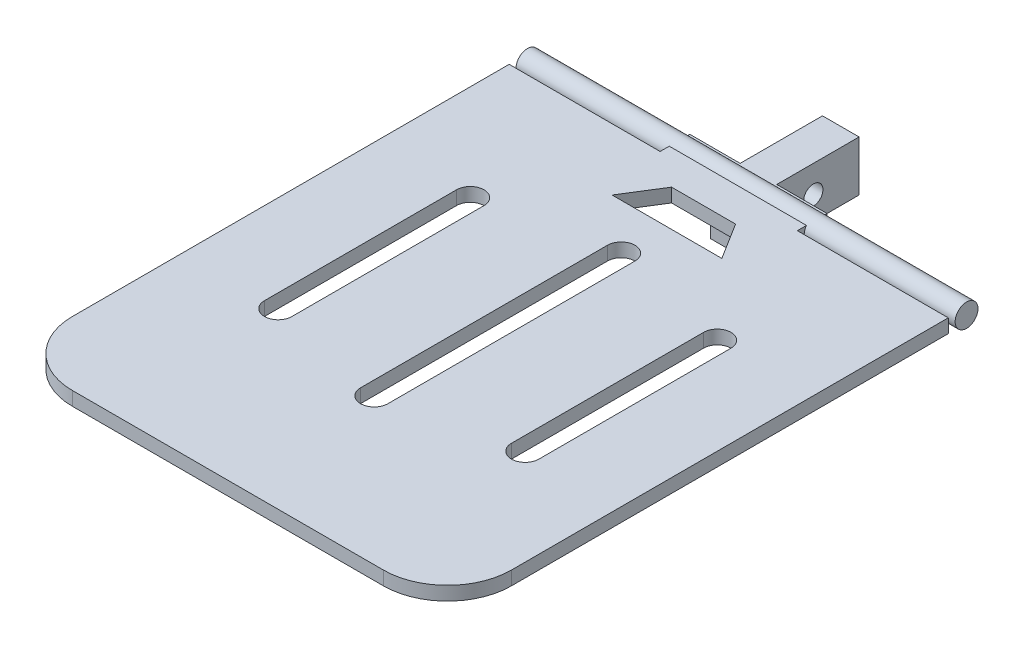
ISO-10303-21;
HEADER;
FILE_DESCRIPTION(('STEP AP214'),'2;1');
FILE_NAME('part.step','',(''),(''),'','','');
FILE_SCHEMA(('AUTOMOTIVE_DESIGN { 1 0 10303 214 1 1 1 1 }'));
ENDSEC;
DATA;
#1=APPLICATION_CONTEXT('core data for automotive mechanical design processes');
#2=APPLICATION_PROTOCOL_DEFINITION('international standard','automotive_design',2000,#1);
#3=PRODUCT_CONTEXT('',#1,'mechanical');
#4=PRODUCT('Part','Part','',(#3));
#5=PRODUCT_RELATED_PRODUCT_CATEGORY('part','',(#4));
#6=PRODUCT_DEFINITION_FORMATION('','',#4);
#7=PRODUCT_DEFINITION_CONTEXT('part definition',#1,'design');
#8=PRODUCT_DEFINITION('design','',#6,#7);
#9=PRODUCT_DEFINITION_SHAPE('','',#8);
#10=(LENGTH_UNIT() NAMED_UNIT(*) SI_UNIT(.MILLI.,.METRE.));
#11=(NAMED_UNIT(*) PLANE_ANGLE_UNIT() SI_UNIT($,.RADIAN.));
#12=(NAMED_UNIT(*) SI_UNIT($,.STERADIAN.) SOLID_ANGLE_UNIT());
#13=UNCERTAINTY_MEASURE_WITH_UNIT(LENGTH_MEASURE(1.E-05),#10,'distance_accuracy_value','');
#14=(GEOMETRIC_REPRESENTATION_CONTEXT(3) GLOBAL_UNCERTAINTY_ASSIGNED_CONTEXT((#13)) GLOBAL_UNIT_ASSIGNED_CONTEXT((#10,
#11,#12)) REPRESENTATION_CONTEXT('',''));
#15=CARTESIAN_POINT('',(0.,0.,0.));
#16=DIRECTION('',(0.,0.,1.));
#17=DIRECTION('',(1.,0.,0.));
#18=AXIS2_PLACEMENT_3D('',#15,#16,#17);
#19=CARTESIAN_POINT('',(34.,6.,110.));
#20=DIRECTION('',(0.,-1.,0.));
#21=DIRECTION('',(0.,0.,-1.));
#22=AXIS2_PLACEMENT_3D('',#19,#20,#21);
#23=PLANE('',#22);
#24=CARTESIAN_POINT('',(27.,6.,44.));
#25=DIRECTION('',(0.,-1.,0.));
#26=DIRECTION('',(0.,0.,-1.));
#27=AXIS2_PLACEMENT_3D('',#24,#25,#26);
#28=CIRCLE('',#27,3.);
#29=CARTESIAN_POINT('',(30.,6.,44.));
#30=VERTEX_POINT('',#29);
#31=CARTESIAN_POINT('',(24.,6.,44.));
#32=VERTEX_POINT('',#31);
#33=EDGE_CURVE('E520',#30,#32,#28,.F.);
#34=ORIENTED_EDGE('',*,*,#33,.F.);
#35=DIRECTION('',(0.,0.,-1.));
#36=VECTOR('',#35,1.);
#37=CARTESIAN_POINT('',(30.,6.,110.));
#38=LINE('',#37,#36);
#39=CARTESIAN_POINT('',(30.,6.,86.));
#40=VERTEX_POINT('',#39);
#41=EDGE_CURVE('E513',#40,#30,#38,.T.);
#42=ORIENTED_EDGE('',*,*,#41,.F.);
#43=CARTESIAN_POINT('',(27.,6.,86.));
#44=DIRECTION('',(0.,-1.,0.));
#45=DIRECTION('',(0.,0.,-1.));
#46=AXIS2_PLACEMENT_3D('',#43,#44,#45);
#47=CIRCLE('',#46,3.);
#48=CARTESIAN_POINT('',(24.,6.,86.));
#49=VERTEX_POINT('',#48);
#50=EDGE_CURVE('E515',#49,#40,#47,.F.);
#51=ORIENTED_EDGE('',*,*,#50,.F.);
#52=DIRECTION('',(0.,0.,1.));
#53=VECTOR('',#52,1.);
#54=CARTESIAN_POINT('',(24.,6.,110.));
#55=LINE('',#54,#53);
#56=EDGE_CURVE('E518',#32,#49,#55,.T.);
#57=ORIENTED_EDGE('',*,*,#56,.F.);
#58=EDGE_LOOP('',(#34,#42,#51,#57));
#59=FACE_BOUND('',#58,.T.);
#60=CARTESIAN_POINT('',(0.,6.,38.));
#61=DIRECTION('',(0.,-1.,0.));
#62=DIRECTION('',(0.,0.,-1.));
#63=AXIS2_PLACEMENT_3D('',#60,#61,#62);
#64=CIRCLE('',#63,3.);
#65=CARTESIAN_POINT('',(3.,6.,38.));
#66=VERTEX_POINT('',#65);
#67=CARTESIAN_POINT('',(-3.,6.,38.));
#68=VERTEX_POINT('',#67);
#69=EDGE_CURVE('E478',#66,#68,#64,.F.);
#70=ORIENTED_EDGE('',*,*,#69,.F.);
#71=DIRECTION('',(0.,0.,-1.));
#72=VECTOR('',#71,1.);
#73=CARTESIAN_POINT('',(3.,6.,110.));
#74=LINE('',#73,#72);
#75=CARTESIAN_POINT('',(3.,6.,92.));
#76=VERTEX_POINT('',#75);
#77=EDGE_CURVE('E471',#76,#66,#74,.T.);
#78=ORIENTED_EDGE('',*,*,#77,.F.);
#79=CARTESIAN_POINT('',(0.,6.,92.));
#80=DIRECTION('',(0.,-1.,0.));
#81=DIRECTION('',(0.,0.,-1.));
#82=AXIS2_PLACEMENT_3D('',#79,#80,#81);
#83=CIRCLE('',#82,3.);
#84=CARTESIAN_POINT('',(-3.,6.,92.));
#85=VERTEX_POINT('',#84);
#86=EDGE_CURVE('E473',#85,#76,#83,.F.);
#87=ORIENTED_EDGE('',*,*,#86,.F.);
#88=DIRECTION('',(0.,0.,1.));
#89=VECTOR('',#88,1.);
#90=CARTESIAN_POINT('',(-3.,6.,110.));
#91=LINE('',#90,#89);
#92=EDGE_CURVE('E476',#68,#85,#91,.T.);
#93=ORIENTED_EDGE('',*,*,#92,.F.);
#94=EDGE_LOOP('',(#70,#78,#87,#93));
#95=FACE_BOUND('',#94,.T.);
#96=DIRECTION('',(1.,0.,0.));
#97=VECTOR('',#96,1.);
#98=CARTESIAN_POINT('',(-48.,6.,12.5));
#99=LINE('',#98,#97);
#100=CARTESIAN_POINT('',(15.,6.,12.5));
#101=VERTEX_POINT('',#100);
#102=CARTESIAN_POINT('',(-15.,6.,12.5));
#103=VERTEX_POINT('',#102);
#104=EDGE_CURVE('E375',#101,#103,#99,.F.);
#105=ORIENTED_EDGE('',*,*,#104,.T.);
#106=DIRECTION('',(0.,0.,1.));
#107=VECTOR('',#106,1.);
#108=CARTESIAN_POINT('',(-15.,6.,16.));
#109=LINE('',#108,#107);
#110=CARTESIAN_POINT('',(-15.,6.,14.5));
#111=VERTEX_POINT('',#110);
#112=EDGE_CURVE('E396',#103,#111,#109,.T.);
#113=ORIENTED_EDGE('',*,*,#112,.T.);
#114=DIRECTION('',(-1.,0.,0.));
#115=VECTOR('',#114,1.);
#116=CARTESIAN_POINT('',(-48.,6.,14.5));
#117=LINE('',#116,#115);
#118=CARTESIAN_POINT('',(-48.,6.,14.5));
#119=VERTEX_POINT('',#118);
#120=EDGE_CURVE('E451',#111,#119,#117,.T.);
#121=ORIENTED_EDGE('',*,*,#120,.T.);
#122=DIRECTION('',(0.,0.,1.));
#123=VECTOR('',#122,1.);
#124=CARTESIAN_POINT('',(-48.,6.,110.));
#125=LINE('',#124,#123);
#126=CARTESIAN_POINT('',(-48.,6.,110.));
#127=VERTEX_POINT('',#126);
#128=EDGE_CURVE('E415',#119,#127,#125,.T.);
#129=ORIENTED_EDGE('',*,*,#128,.T.);
#130=CARTESIAN_POINT('',(-34.,6.,110.));
#131=DIRECTION('',(0.,1.,0.));
#132=DIRECTION('',(0.,0.,-1.));
#133=AXIS2_PLACEMENT_3D('',#130,#131,#132);
#134=CIRCLE('',#133,14.);
#135=CARTESIAN_POINT('',(-34.,6.,124.));
#136=VERTEX_POINT('',#135);
#137=EDGE_CURVE('E439',#127,#136,#134,.T.);
#138=ORIENTED_EDGE('',*,*,#137,.T.);
#139=DIRECTION('',(1.,0.,0.));
#140=VECTOR('',#139,1.);
#141=CARTESIAN_POINT('',(34.,6.,124.));
#142=LINE('',#141,#140);
#143=CARTESIAN_POINT('',(34.,6.,124.));
#144=VERTEX_POINT('',#143);
#145=EDGE_CURVE('E442',#136,#144,#142,.T.);
#146=ORIENTED_EDGE('',*,*,#145,.T.);
#147=CARTESIAN_POINT('',(34.,6.,110.));
#148=DIRECTION('',(0.,1.,0.));
#149=DIRECTION('',(0.,0.,-1.));
#150=AXIS2_PLACEMENT_3D('',#147,#148,#149);
#151=CIRCLE('',#150,14.);
#152=CARTESIAN_POINT('',(48.,6.,110.));
#153=VERTEX_POINT('',#152);
#154=EDGE_CURVE('E445',#144,#153,#151,.T.);
#155=ORIENTED_EDGE('',*,*,#154,.T.);
#156=DIRECTION('',(0.,0.,-1.));
#157=VECTOR('',#156,1.);
#158=CARTESIAN_POINT('',(48.,6.,14.5));
#159=LINE('',#158,#157);
#160=CARTESIAN_POINT('',(48.,6.,14.5));
#161=VERTEX_POINT('',#160);
#162=EDGE_CURVE('E448',#153,#161,#159,.T.);
#163=ORIENTED_EDGE('',*,*,#162,.T.);
#164=CARTESIAN_POINT('',(15.,6.,14.5));
#165=VERTEX_POINT('',#164);
#166=EDGE_CURVE('E420',#161,#165,#117,.T.);
#167=ORIENTED_EDGE('',*,*,#166,.T.);
#168=DIRECTION('',(0.,0.,-1.));
#169=VECTOR('',#168,1.);
#170=CARTESIAN_POINT('',(15.,6.,16.));
#171=LINE('',#170,#169);
#172=EDGE_CURVE('E397',#165,#101,#171,.T.);
#173=ORIENTED_EDGE('',*,*,#172,.T.);
#174=EDGE_LOOP('',(#105,#113,#121,#129,#138,#146,#155,#163,#167,#173));
#175=FACE_BOUND('',#174,.T.);
#176=CARTESIAN_POINT('',(-27.,6.,44.));
#177=DIRECTION('',(0.,-1.,0.));
#178=DIRECTION('',(0.,0.,-1.));
#179=AXIS2_PLACEMENT_3D('',#176,#177,#178);
#180=CIRCLE('',#179,3.);
#181=CARTESIAN_POINT('',(-24.,6.,44.));
#182=VERTEX_POINT('',#181);
#183=CARTESIAN_POINT('',(-30.,6.,44.));
#184=VERTEX_POINT('',#183);
#185=EDGE_CURVE('E499',#182,#184,#180,.F.);
#186=ORIENTED_EDGE('',*,*,#185,.F.);
#187=DIRECTION('',(0.,0.,-1.));
#188=VECTOR('',#187,1.);
#189=CARTESIAN_POINT('',(-24.,6.,110.));
#190=LINE('',#189,#188);
#191=CARTESIAN_POINT('',(-24.,6.,86.));
#192=VERTEX_POINT('',#191);
#193=EDGE_CURVE('E492',#192,#182,#190,.T.);
#194=ORIENTED_EDGE('',*,*,#193,.F.);
#195=CARTESIAN_POINT('',(-27.,6.,86.));
#196=DIRECTION('',(0.,-1.,0.));
#197=DIRECTION('',(0.,0.,-1.));
#198=AXIS2_PLACEMENT_3D('',#195,#196,#197);
#199=CIRCLE('',#198,3.);
#200=CARTESIAN_POINT('',(-30.,6.,86.));
#201=VERTEX_POINT('',#200);
#202=EDGE_CURVE('E494',#201,#192,#199,.F.);
#203=ORIENTED_EDGE('',*,*,#202,.F.);
#204=DIRECTION('',(0.,0.,1.));
#205=VECTOR('',#204,1.);
#206=CARTESIAN_POINT('',(-30.,6.,110.));
#207=LINE('',#206,#205);
#208=EDGE_CURVE('E497',#184,#201,#207,.T.);
#209=ORIENTED_EDGE('',*,*,#208,.F.);
#210=EDGE_LOOP('',(#186,#194,#203,#209));
#211=FACE_BOUND('',#210,.T.);
#212=DIRECTION('',(-0.52999894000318,0.,0.847998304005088));
#213=VECTOR('',#212,1.);
#214=CARTESIAN_POINT('',(-35.9325842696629,6.,66.2921348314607));
#215=LINE('',#214,#213);
#216=CARTESIAN_POINT('',(-7.,6.,20.));
#217=VERTEX_POINT('',#216);
#218=CARTESIAN_POINT('',(-12.,6.,28.));
#219=VERTEX_POINT('',#218);
#220=EDGE_CURVE('E298',#217,#219,#215,.T.);
#221=ORIENTED_EDGE('',*,*,#220,.F.);
#222=DIRECTION('',(-1.,0.,0.));
#223=VECTOR('',#222,1.);
#224=CARTESIAN_POINT('',(34.,6.,20.));
#225=LINE('',#224,#223);
#226=CARTESIAN_POINT('',(7.,6.,20.));
#227=VERTEX_POINT('',#226);
#228=EDGE_CURVE('E534',#227,#217,#225,.T.);
#229=ORIENTED_EDGE('',*,*,#228,.F.);
#230=DIRECTION('',(-0.52999894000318,0.,-0.847998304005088));
#231=VECTOR('',#230,1.);
#232=CARTESIAN_POINT('',(55.0337078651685,6.,96.8539325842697));
#233=LINE('',#232,#231);
#234=CARTESIAN_POINT('',(12.,6.,28.));
#235=VERTEX_POINT('',#234);
#236=EDGE_CURVE('E536',#235,#227,#233,.T.);
#237=ORIENTED_EDGE('',*,*,#236,.F.);
#238=DIRECTION('',(1.,0.,0.));
#239=VECTOR('',#238,1.);
#240=CARTESIAN_POINT('',(34.,6.,28.));
#241=LINE('',#240,#239);
#242=EDGE_CURVE('E538',#219,#235,#241,.T.);
#243=ORIENTED_EDGE('',*,*,#242,.F.);
#244=EDGE_LOOP('',(#221,#229,#237,#243));
#245=FACE_BOUND('',#244,.T.);
#246=ADVANCED_FACE('F39',(#59,#95,#175,#211,#245),#23,.F.);
#247=CARTESIAN_POINT('',(34.,3.,110.));
#248=DIRECTION('',(0.,-1.,0.));
#249=DIRECTION('',(0.,0.,-1.));
#250=AXIS2_PLACEMENT_3D('',#247,#248,#249);
#251=PLANE('',#250);
#252=DIRECTION('',(0.,0.,-1.));
#253=VECTOR('',#252,1.);
#254=CARTESIAN_POINT('',(-4.,3.,110.));
#255=LINE('',#254,#253);
#256=CARTESIAN_POINT('',(-4.,3.,8.49999999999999));
#257=VERTEX_POINT('',#256);
#258=CARTESIAN_POINT('',(-4.,3.,8.));
#259=VERTEX_POINT('',#258);
#260=EDGE_CURVE('E355',#257,#259,#255,.T.);
#261=ORIENTED_EDGE('',*,*,#260,.F.);
#262=DIRECTION('',(1.,0.,0.));
#263=VECTOR('',#262,1.);
#264=CARTESIAN_POINT('',(-48.,3.,8.5));
#265=LINE('',#264,#263);
#266=CARTESIAN_POINT('',(-15.,3.,8.5));
#267=VERTEX_POINT('',#266);
#268=EDGE_CURVE('E367',#267,#257,#265,.T.);
#269=ORIENTED_EDGE('',*,*,#268,.F.);
#270=DIRECTION('',(0.,0.,1.));
#271=VECTOR('',#270,1.);
#272=CARTESIAN_POINT('',(-15.,3.,16.));
#273=LINE('',#272,#271);
#274=CARTESIAN_POINT('',(-15.,3.,8.));
#275=VERTEX_POINT('',#274);
#276=EDGE_CURVE('E380',#275,#267,#273,.T.);
#277=ORIENTED_EDGE('',*,*,#276,.F.);
#278=DIRECTION('',(-1.,0.,0.));
#279=VECTOR('',#278,1.);
#280=CARTESIAN_POINT('',(-15.,3.,8.));
#281=LINE('',#280,#279);
#282=EDGE_CURVE('E387',#259,#275,#281,.T.);
#283=ORIENTED_EDGE('',*,*,#282,.F.);
#284=EDGE_LOOP('',(#261,#269,#277,#283));
#285=FACE_BOUND('',#284,.T.);
#286=ADVANCED_FACE('F557',(#285),#251,.T.);
#287=CARTESIAN_POINT('',(-15.,3.,8.));
#288=DIRECTION('',(0.,0.,-1.));
#289=DIRECTION('',(-1.,0.,0.));
#290=AXIS2_PLACEMENT_3D('',#287,#288,#289);
#291=PLANE('',#290);
#292=DIRECTION('',(0.,1.,0.));
#293=VECTOR('',#292,1.);
#294=CARTESIAN_POINT('',(-4.,3.,8.));
#295=LINE('',#294,#293);
#296=CARTESIAN_POINT('',(-4.,6.,8.));
#297=VERTEX_POINT('',#296);
#298=EDGE_CURVE('E609',#259,#297,#295,.T.);
#299=ORIENTED_EDGE('',*,*,#298,.F.);
#300=ORIENTED_EDGE('',*,*,#282,.T.);
#301=DIRECTION('',(0.,1.,0.));
#302=VECTOR('',#301,1.);
#303=CARTESIAN_POINT('',(-15.,3.,8.));
#304=LINE('',#303,#302);
#305=CARTESIAN_POINT('',(-15.,4.5,8.));
#306=VERTEX_POINT('',#305);
#307=EDGE_CURVE('E404',#275,#306,#304,.T.);
#308=ORIENTED_EDGE('',*,*,#307,.T.);
#309=CARTESIAN_POINT('',(-15.,6.,8.));
#310=VERTEX_POINT('',#309);
#311=EDGE_CURVE('E408',#306,#310,#304,.T.);
#312=ORIENTED_EDGE('',*,*,#311,.T.);
#313=DIRECTION('',(-1.,0.,0.));
#314=VECTOR('',#313,1.);
#315=CARTESIAN_POINT('',(-15.,6.,8.));
#316=LINE('',#315,#314);
#317=EDGE_CURVE('E400',#297,#310,#316,.T.);
#318=ORIENTED_EDGE('',*,*,#317,.F.);
#319=EDGE_LOOP('',(#299,#300,#308,#312,#318));
#320=FACE_BOUND('',#319,.T.);
#321=ADVANCED_FACE('F563',(#320),#291,.T.);
#322=CARTESIAN_POINT('',(15.,3.,16.));
#323=DIRECTION('',(1.,0.,0.));
#324=DIRECTION('',(0.,0.,-1.));
#325=AXIS2_PLACEMENT_3D('',#322,#323,#324);
#326=PLANE('',#325);
#327=CARTESIAN_POINT('',(15.,4.5,10.5));
#328=DIRECTION('',(1.,0.,0.));
#329=DIRECTION('',(0.,0.,-1.));
#330=AXIS2_PLACEMENT_3D('',#327,#328,#329);
#331=CIRCLE('',#330,2.5);
#332=CARTESIAN_POINT('',(15.,3.,12.5));
#333=VERTEX_POINT('',#332);
#334=EDGE_CURVE('E470',#101,#333,#331,.T.);
#335=ORIENTED_EDGE('',*,*,#334,.F.);
#336=ORIENTED_EDGE('',*,*,#172,.F.);
#337=DIRECTION('',(0.,-1.,0.));
#338=VECTOR('',#337,1.);
#339=CARTESIAN_POINT('',(15.,3.,14.5));
#340=LINE('',#339,#338);
#341=CARTESIAN_POINT('',(15.,3.,14.5));
#342=VERTEX_POINT('',#341);
#343=EDGE_CURVE('E407',#165,#342,#340,.T.);
#344=ORIENTED_EDGE('',*,*,#343,.T.);
#345=DIRECTION('',(0.,0.,-1.));
#346=VECTOR('',#345,1.);
#347=CARTESIAN_POINT('',(15.,3.,16.));
#348=LINE('',#347,#346);
#349=EDGE_CURVE('E385',#342,#333,#348,.T.);
#350=ORIENTED_EDGE('',*,*,#349,.T.);
#351=EDGE_LOOP('',(#335,#336,#344,#350));
#352=FACE_BOUND('',#351,.T.);
#353=ADVANCED_FACE('F666',(#352),#326,.T.);
#354=CARTESIAN_POINT('',(-48.,3.,14.5));
#355=DIRECTION('',(0.,0.,-1.));
#356=DIRECTION('',(-1.,0.,0.));
#357=AXIS2_PLACEMENT_3D('',#354,#355,#356);
#358=PLANE('',#357);
#359=DIRECTION('',(0.,1.,0.));
#360=VECTOR('',#359,1.);
#361=CARTESIAN_POINT('',(-15.,3.,14.5));
#362=LINE('',#361,#360);
#363=CARTESIAN_POINT('',(-15.,3.,14.5));
#364=VERTEX_POINT('',#363);
#365=EDGE_CURVE('E412',#364,#111,#362,.T.);
#366=ORIENTED_EDGE('',*,*,#365,.F.);
#367=DIRECTION('',(-1.,0.,0.));
#368=VECTOR('',#367,1.);
#369=CARTESIAN_POINT('',(-48.,3.,14.5));
#370=LINE('',#369,#368);
#371=CARTESIAN_POINT('',(-48.,3.,14.5));
#372=VERTEX_POINT('',#371);
#373=EDGE_CURVE('E432',#364,#372,#370,.T.);
#374=ORIENTED_EDGE('',*,*,#373,.T.);
#375=DIRECTION('',(0.,1.,0.));
#376=VECTOR('',#375,1.);
#377=CARTESIAN_POINT('',(-48.,3.,14.5));
#378=LINE('',#377,#376);
#379=EDGE_CURVE('E454',#372,#119,#378,.T.);
#380=ORIENTED_EDGE('',*,*,#379,.T.);
#381=ORIENTED_EDGE('',*,*,#120,.F.);
#382=EDGE_LOOP('',(#366,#374,#380,#381));
#383=FACE_BOUND('',#382,.T.);
#384=ADVANCED_FACE('F640',(#383),#358,.T.);
#385=CARTESIAN_POINT('',(-48.,3.,110.));
#386=DIRECTION('',(-1.,0.,0.));
#387=DIRECTION('',(0.,0.,1.));
#388=AXIS2_PLACEMENT_3D('',#385,#386,#387);
#389=PLANE('',#388);
#390=ORIENTED_EDGE('',*,*,#128,.F.);
#391=ORIENTED_EDGE('',*,*,#379,.F.);
#392=DIRECTION('',(0.,0.,1.));
#393=VECTOR('',#392,1.);
#394=CARTESIAN_POINT('',(-48.,3.,110.));
#395=LINE('',#394,#393);
#396=CARTESIAN_POINT('',(-48.,3.,110.));
#397=VERTEX_POINT('',#396);
#398=EDGE_CURVE('E416',#372,#397,#395,.T.);
#399=ORIENTED_EDGE('',*,*,#398,.T.);
#400=DIRECTION('',(0.,1.,0.));
#401=VECTOR('',#400,1.);
#402=CARTESIAN_POINT('',(-48.,3.,110.));
#403=LINE('',#402,#401);
#404=EDGE_CURVE('E436',#397,#127,#403,.T.);
#405=ORIENTED_EDGE('',*,*,#404,.T.);
#406=EDGE_LOOP('',(#390,#391,#399,#405));
#407=FACE_BOUND('',#406,.T.);
#408=ADVANCED_FACE('F41',(#407),#389,.T.);
#409=ORIENTED_EDGE('',*,*,#343,.F.);
#410=ORIENTED_EDGE('',*,*,#166,.F.);
#411=DIRECTION('',(0.,1.,0.));
#412=VECTOR('',#411,1.);
#413=CARTESIAN_POINT('',(48.,3.,14.5));
#414=LINE('',#413,#412);
#415=CARTESIAN_POINT('',(48.,3.,14.5));
#416=VERTEX_POINT('',#415);
#417=EDGE_CURVE('E458',#416,#161,#414,.T.);
#418=ORIENTED_EDGE('',*,*,#417,.F.);
#419=EDGE_CURVE('E433',#416,#342,#370,.T.);
#420=ORIENTED_EDGE('',*,*,#419,.T.);
#421=EDGE_LOOP('',(#409,#410,#418,#420));
#422=FACE_BOUND('',#421,.T.);
#423=ADVANCED_FACE('F662',(#422),#358,.T.);
#424=CARTESIAN_POINT('',(48.,3.,14.5));
#425=DIRECTION('',(1.,0.,0.));
#426=DIRECTION('',(0.,0.,-1.));
#427=AXIS2_PLACEMENT_3D('',#424,#425,#426);
#428=PLANE('',#427);
#429=ORIENTED_EDGE('',*,*,#162,.F.);
#430=DIRECTION('',(0.,1.,0.));
#431=VECTOR('',#430,1.);
#432=CARTESIAN_POINT('',(48.,3.,110.));
#433=LINE('',#432,#431);
#434=CARTESIAN_POINT('',(48.,3.,110.));
#435=VERTEX_POINT('',#434);
#436=EDGE_CURVE('E460',#435,#153,#433,.T.);
#437=ORIENTED_EDGE('',*,*,#436,.F.);
#438=DIRECTION('',(0.,0.,-1.));
#439=VECTOR('',#438,1.);
#440=CARTESIAN_POINT('',(48.,3.,14.5));
#441=LINE('',#440,#439);
#442=EDGE_CURVE('E429',#435,#416,#441,.T.);
#443=ORIENTED_EDGE('',*,*,#442,.T.);
#444=ORIENTED_EDGE('',*,*,#417,.T.);
#445=EDGE_LOOP('',(#429,#437,#443,#444));
#446=FACE_BOUND('',#445,.T.);
#447=ADVANCED_FACE('F1056',(#446),#428,.T.);
#448=CARTESIAN_POINT('',(34.,3.,110.));
#449=DIRECTION('',(0.,1.,0.));
#450=DIRECTION('',(0.,0.,1.));
#451=AXIS2_PLACEMENT_3D('',#448,#449,#450);
#452=CYLINDRICAL_SURFACE('',#451,14.);
#453=ORIENTED_EDGE('',*,*,#154,.F.);
#454=DIRECTION('',(0.,1.,0.));
#455=VECTOR('',#454,1.);
#456=CARTESIAN_POINT('',(34.,3.,124.));
#457=LINE('',#456,#455);
#458=CARTESIAN_POINT('',(34.,3.,124.));
#459=VERTEX_POINT('',#458);
#460=EDGE_CURVE('E462',#459,#144,#457,.T.);
#461=ORIENTED_EDGE('',*,*,#460,.F.);
#462=CARTESIAN_POINT('',(34.,3.,110.));
#463=DIRECTION('',(0.,1.,0.));
#464=DIRECTION('',(0.,0.,-1.));
#465=AXIS2_PLACEMENT_3D('',#462,#463,#464);
#466=CIRCLE('',#465,14.);
#467=EDGE_CURVE('E426',#459,#435,#466,.T.);
#468=ORIENTED_EDGE('',*,*,#467,.T.);
#469=ORIENTED_EDGE('',*,*,#436,.T.);
#470=EDGE_LOOP('',(#453,#461,#468,#469));
#471=FACE_BOUND('',#470,.T.);
#472=ADVANCED_FACE('F656',(#471),#452,.T.);
#473=CARTESIAN_POINT('',(34.,3.,124.));
#474=DIRECTION('',(0.,0.,1.));
#475=DIRECTION('',(1.,0.,0.));
#476=AXIS2_PLACEMENT_3D('',#473,#474,#475);
#477=PLANE('',#476);
#478=ORIENTED_EDGE('',*,*,#145,.F.);
#479=DIRECTION('',(0.,1.,0.));
#480=VECTOR('',#479,1.);
#481=CARTESIAN_POINT('',(-34.,3.,124.));
#482=LINE('',#481,#480);
#483=CARTESIAN_POINT('',(-34.,3.,124.));
#484=VERTEX_POINT('',#483);
#485=EDGE_CURVE('E464',#484,#136,#482,.T.);
#486=ORIENTED_EDGE('',*,*,#485,.F.);
#487=DIRECTION('',(1.,0.,0.));
#488=VECTOR('',#487,1.);
#489=CARTESIAN_POINT('',(34.,3.,124.));
#490=LINE('',#489,#488);
#491=EDGE_CURVE('E423',#484,#459,#490,.T.);
#492=ORIENTED_EDGE('',*,*,#491,.T.);
#493=ORIENTED_EDGE('',*,*,#460,.T.);
#494=EDGE_LOOP('',(#478,#486,#492,#493));
#495=FACE_BOUND('',#494,.T.);
#496=ADVANCED_FACE('F652',(#495),#477,.T.);
#497=CARTESIAN_POINT('',(-34.,3.,110.));
#498=DIRECTION('',(0.,1.,0.));
#499=DIRECTION('',(0.,0.,1.));
#500=AXIS2_PLACEMENT_3D('',#497,#498,#499);
#501=CYLINDRICAL_SURFACE('',#500,14.);
#502=ORIENTED_EDGE('',*,*,#137,.F.);
#503=ORIENTED_EDGE('',*,*,#404,.F.);
#504=CARTESIAN_POINT('',(-34.,3.,110.));
#505=DIRECTION('',(0.,1.,0.));
#506=DIRECTION('',(0.,0.,-1.));
#507=AXIS2_PLACEMENT_3D('',#504,#505,#506);
#508=CIRCLE('',#507,14.);
#509=EDGE_CURVE('E419',#397,#484,#508,.T.);
#510=ORIENTED_EDGE('',*,*,#509,.T.);
#511=ORIENTED_EDGE('',*,*,#485,.T.);
#512=EDGE_LOOP('',(#502,#503,#510,#511));
#513=FACE_BOUND('',#512,.T.);
#514=ADVANCED_FACE('F648',(#513),#501,.T.);
#515=DIRECTION('',(0.52999894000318,0.,-0.847998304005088));
#516=VECTOR('',#515,1.);
#517=CARTESIAN_POINT('',(-35.9325842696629,3.,66.2921348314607));
#518=LINE('',#517,#516);
#519=CARTESIAN_POINT('',(-12.,3.,28.));
#520=VERTEX_POINT('',#519);
#521=CARTESIAN_POINT('',(-7.,3.,20.));
#522=VERTEX_POINT('',#521);
#523=EDGE_CURVE('E11',#520,#522,#518,.T.);
#524=ORIENTED_EDGE('',*,*,#523,.F.);
#525=DIRECTION('',(-1.,0.,0.));
#526=VECTOR('',#525,1.);
#527=CARTESIAN_POINT('',(34.,3.,28.));
#528=LINE('',#527,#526);
#529=CARTESIAN_POINT('',(12.,3.,28.));
#530=VERTEX_POINT('',#529);
#531=EDGE_CURVE('E303',#530,#520,#528,.T.);
#532=ORIENTED_EDGE('',*,*,#531,.F.);
#533=DIRECTION('',(0.52999894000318,0.,0.847998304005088));
#534=VECTOR('',#533,1.);
#535=CARTESIAN_POINT('',(55.0337078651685,3.,96.8539325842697));
#536=LINE('',#535,#534);
#537=CARTESIAN_POINT('',(7.,3.,20.));
#538=VERTEX_POINT('',#537);
#539=EDGE_CURVE('E307',#538,#530,#536,.T.);
#540=ORIENTED_EDGE('',*,*,#539,.F.);
#541=DIRECTION('',(1.,0.,0.));
#542=VECTOR('',#541,1.);
#543=CARTESIAN_POINT('',(34.,3.,20.));
#544=LINE('',#543,#542);
#545=EDGE_CURVE('E48',#522,#538,#544,.T.);
#546=ORIENTED_EDGE('',*,*,#545,.F.);
#547=EDGE_LOOP('',(#524,#532,#540,#546));
#548=FACE_BOUND('',#547,.T.);
#549=CARTESIAN_POINT('',(27.,3.,44.));
#550=DIRECTION('',(0.,-1.,0.));
#551=DIRECTION('',(0.,0.,-1.));
#552=AXIS2_PLACEMENT_3D('',#549,#550,#551);
#553=CIRCLE('',#552,3.);
#554=CARTESIAN_POINT('',(24.,3.,44.));
#555=VERTEX_POINT('',#554);
#556=CARTESIAN_POINT('',(30.,3.,44.));
#557=VERTEX_POINT('',#556);
#558=EDGE_CURVE('E531',#555,#557,#553,.T.);
#559=ORIENTED_EDGE('',*,*,#558,.F.);
#560=DIRECTION('',(0.,0.,-1.));
#561=VECTOR('',#560,1.);
#562=CARTESIAN_POINT('',(24.,3.,110.));
#563=LINE('',#562,#561);
#564=CARTESIAN_POINT('',(24.,3.,86.));
#565=VERTEX_POINT('',#564);
#566=EDGE_CURVE('E522',#565,#555,#563,.T.);
#567=ORIENTED_EDGE('',*,*,#566,.F.);
#568=CARTESIAN_POINT('',(27.,3.,86.));
#569=DIRECTION('',(0.,-1.,0.));
#570=DIRECTION('',(0.,0.,-1.));
#571=AXIS2_PLACEMENT_3D('',#568,#569,#570);
#572=CIRCLE('',#571,3.);
#573=CARTESIAN_POINT('',(30.,3.,86.));
#574=VERTEX_POINT('',#573);
#575=EDGE_CURVE('E525',#574,#565,#572,.T.);
#576=ORIENTED_EDGE('',*,*,#575,.F.);
#577=DIRECTION('',(0.,0.,1.));
#578=VECTOR('',#577,1.);
#579=CARTESIAN_POINT('',(30.,3.,110.));
#580=LINE('',#579,#578);
#581=EDGE_CURVE('E528',#557,#574,#580,.T.);
#582=ORIENTED_EDGE('',*,*,#581,.F.);
#583=EDGE_LOOP('',(#559,#567,#576,#582));
#584=FACE_BOUND('',#583,.T.);
#585=CARTESIAN_POINT('',(-27.,3.,44.));
#586=DIRECTION('',(0.,-1.,0.));
#587=DIRECTION('',(0.,0.,-1.));
#588=AXIS2_PLACEMENT_3D('',#585,#586,#587);
#589=CIRCLE('',#588,3.);
#590=CARTESIAN_POINT('',(-30.,3.,44.));
#591=VERTEX_POINT('',#590);
#592=CARTESIAN_POINT('',(-24.,3.,44.));
#593=VERTEX_POINT('',#592);
#594=EDGE_CURVE('E510',#591,#593,#589,.T.);
#595=ORIENTED_EDGE('',*,*,#594,.F.);
#596=DIRECTION('',(0.,0.,-1.));
#597=VECTOR('',#596,1.);
#598=CARTESIAN_POINT('',(-30.,3.,110.));
#599=LINE('',#598,#597);
#600=CARTESIAN_POINT('',(-30.,3.,86.));
#601=VERTEX_POINT('',#600);
#602=EDGE_CURVE('E501',#601,#591,#599,.T.);
#603=ORIENTED_EDGE('',*,*,#602,.F.);
#604=CARTESIAN_POINT('',(-27.,3.,86.));
#605=DIRECTION('',(0.,-1.,0.));
#606=DIRECTION('',(0.,0.,-1.));
#607=AXIS2_PLACEMENT_3D('',#604,#605,#606);
#608=CIRCLE('',#607,3.);
#609=CARTESIAN_POINT('',(-24.,3.,86.));
#610=VERTEX_POINT('',#609);
#611=EDGE_CURVE('E504',#610,#601,#608,.T.);
#612=ORIENTED_EDGE('',*,*,#611,.F.);
#613=DIRECTION('',(0.,0.,1.));
#614=VECTOR('',#613,1.);
#615=CARTESIAN_POINT('',(-24.,3.,110.));
#616=LINE('',#615,#614);
#617=EDGE_CURVE('E507',#593,#610,#616,.T.);
#618=ORIENTED_EDGE('',*,*,#617,.F.);
#619=EDGE_LOOP('',(#595,#603,#612,#618));
#620=FACE_BOUND('',#619,.T.);
#621=CARTESIAN_POINT('',(0.,3.,38.));
#622=DIRECTION('',(0.,-1.,0.));
#623=DIRECTION('',(0.,0.,-1.));
#624=AXIS2_PLACEMENT_3D('',#621,#622,#623);
#625=CIRCLE('',#624,3.);
#626=CARTESIAN_POINT('',(-3.,3.,38.));
#627=VERTEX_POINT('',#626);
#628=CARTESIAN_POINT('',(3.,3.,38.));
#629=VERTEX_POINT('',#628);
#630=EDGE_CURVE('E489',#627,#629,#625,.T.);
#631=ORIENTED_EDGE('',*,*,#630,.F.);
#632=DIRECTION('',(0.,0.,-1.));
#633=VECTOR('',#632,1.);
#634=CARTESIAN_POINT('',(-3.,3.,110.));
#635=LINE('',#634,#633);
#636=CARTESIAN_POINT('',(-3.,3.,92.));
#637=VERTEX_POINT('',#636);
#638=EDGE_CURVE('E480',#637,#627,#635,.T.);
#639=ORIENTED_EDGE('',*,*,#638,.F.);
#640=CARTESIAN_POINT('',(0.,3.,92.));
#641=DIRECTION('',(0.,-1.,0.));
#642=DIRECTION('',(0.,0.,-1.));
#643=AXIS2_PLACEMENT_3D('',#640,#641,#642);
#644=CIRCLE('',#643,3.);
#645=CARTESIAN_POINT('',(3.,3.,92.));
#646=VERTEX_POINT('',#645);
#647=EDGE_CURVE('E483',#646,#637,#644,.T.);
#648=ORIENTED_EDGE('',*,*,#647,.F.);
#649=DIRECTION('',(0.,0.,1.));
#650=VECTOR('',#649,1.);
#651=CARTESIAN_POINT('',(3.,3.,110.));
#652=LINE('',#651,#650);
#653=EDGE_CURVE('E486',#629,#646,#652,.T.);
#654=ORIENTED_EDGE('',*,*,#653,.F.);
#655=EDGE_LOOP('',(#631,#639,#648,#654));
#656=FACE_BOUND('',#655,.T.);
#657=DIRECTION('',(0.,0.,-1.));
#658=VECTOR('',#657,1.);
#659=CARTESIAN_POINT('',(-4.,3.,110.));
#660=LINE('',#659,#658);
#661=CARTESIAN_POINT('',(-4.,3.,14.5));
#662=VERTEX_POINT('',#661);
#663=CARTESIAN_POINT('',(-4.,3.,12.5));
#664=VERTEX_POINT('',#663);
#665=EDGE_CURVE('E334',#662,#664,#660,.T.);
#666=ORIENTED_EDGE('',*,*,#665,.F.);
#667=DIRECTION('',(-1.,0.,0.));
#668=VECTOR('',#667,1.);
#669=CARTESIAN_POINT('',(34.,3.,14.5));
#670=LINE('',#669,#668);
#671=CARTESIAN_POINT('',(4.,3.,14.5));
#672=VERTEX_POINT('',#671);
#673=EDGE_CURVE('E348',#672,#662,#670,.T.);
#674=ORIENTED_EDGE('',*,*,#673,.F.);
#675=DIRECTION('',(0.,0.,1.));
#676=VECTOR('',#675,1.);
#677=CARTESIAN_POINT('',(4.,3.,110.));
#678=LINE('',#677,#676);
#679=CARTESIAN_POINT('',(4.,3.,12.5));
#680=VERTEX_POINT('',#679);
#681=EDGE_CURVE('E607',#680,#672,#678,.T.);
#682=ORIENTED_EDGE('',*,*,#681,.F.);
#683=DIRECTION('',(1.,0.,0.));
#684=VECTOR('',#683,1.);
#685=CARTESIAN_POINT('',(-48.,3.,12.5));
#686=LINE('',#685,#684);
#687=EDGE_CURVE('E377',#333,#680,#686,.F.);
#688=ORIENTED_EDGE('',*,*,#687,.F.);
#689=ORIENTED_EDGE('',*,*,#349,.F.);
#690=ORIENTED_EDGE('',*,*,#419,.F.);
#691=ORIENTED_EDGE('',*,*,#442,.F.);
#692=ORIENTED_EDGE('',*,*,#467,.F.);
#693=ORIENTED_EDGE('',*,*,#491,.F.);
#694=ORIENTED_EDGE('',*,*,#509,.F.);
#695=ORIENTED_EDGE('',*,*,#398,.F.);
#696=ORIENTED_EDGE('',*,*,#373,.F.);
#697=CARTESIAN_POINT('',(-15.,3.,12.5));
#698=VERTEX_POINT('',#697);
#699=EDGE_CURVE('E384',#698,#364,#273,.T.);
#700=ORIENTED_EDGE('',*,*,#699,.F.);
#701=EDGE_CURVE('E350',#664,#698,#686,.F.);
#702=ORIENTED_EDGE('',*,*,#701,.F.);
#703=EDGE_LOOP('',(#666,#674,#682,#688,#689,#690,#691,#692,#693,#694,#695,#696,#700,#702));
#704=FACE_BOUND('',#703,.T.);
#705=ADVANCED_FACE('F309',(#548,#584,#620,#656,#704),#251,.T.);
#706=CARTESIAN_POINT('',(-15.,3.,16.));
#707=DIRECTION('',(-1.,0.,0.));
#708=DIRECTION('',(0.,0.,1.));
#709=AXIS2_PLACEMENT_3D('',#706,#707,#708);
#710=PLANE('',#709);
#711=CARTESIAN_POINT('',(-15.,4.5,10.5));
#712=DIRECTION('',(-1.,0.,0.));
#713=DIRECTION('',(0.,0.,1.));
#714=AXIS2_PLACEMENT_3D('',#711,#712,#713);
#715=CIRCLE('',#714,2.5);
#716=EDGE_CURVE('E374',#698,#103,#715,.T.);
#717=ORIENTED_EDGE('',*,*,#716,.F.);
#718=ORIENTED_EDGE('',*,*,#699,.T.);
#719=ORIENTED_EDGE('',*,*,#365,.T.);
#720=ORIENTED_EDGE('',*,*,#112,.F.);
#721=EDGE_LOOP('',(#717,#718,#719,#720));
#722=FACE_BOUND('',#721,.T.);
#723=ADVANCED_FACE('F580',(#722),#710,.T.);
#724=CARTESIAN_POINT('',(-48.,4.5,10.5));
#725=DIRECTION('',(1.,0.,0.));
#726=DIRECTION('',(0.,0.,-1.));
#727=AXIS2_PLACEMENT_3D('',#724,#725,#726);
#728=CYLINDRICAL_SURFACE('',#727,2.5);
#729=CARTESIAN_POINT('',(-4.,4.5,10.5));
#730=DIRECTION('',(-1.,0.,0.));
#731=DIRECTION('',(0.,0.,1.));
#732=AXIS2_PLACEMENT_3D('',#729,#730,#731);
#733=CIRCLE('',#732,2.5);
#734=EDGE_CURVE('E351',#664,#257,#733,.F.);
#735=ORIENTED_EDGE('',*,*,#734,.F.);
#736=ORIENTED_EDGE('',*,*,#701,.T.);
#737=ORIENTED_EDGE('',*,*,#716,.T.);
#738=ORIENTED_EDGE('',*,*,#104,.F.);
#739=ORIENTED_EDGE('',*,*,#334,.T.);
#740=ORIENTED_EDGE('',*,*,#687,.T.);
#741=CARTESIAN_POINT('',(4.,4.5,10.5));
#742=DIRECTION('',(1.,0.,0.));
#743=DIRECTION('',(0.,0.,-1.));
#744=AXIS2_PLACEMENT_3D('',#741,#742,#743);
#745=CIRCLE('',#744,2.5);
#746=CARTESIAN_POINT('',(4.,3.,8.49999999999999));
#747=VERTEX_POINT('',#746);
#748=EDGE_CURVE('E600',#747,#680,#745,.F.);
#749=ORIENTED_EDGE('',*,*,#748,.F.);
#750=CARTESIAN_POINT('',(15.,3.,8.5));
#751=VERTEX_POINT('',#750);
#752=EDGE_CURVE('E366',#747,#751,#265,.T.);
#753=ORIENTED_EDGE('',*,*,#752,.T.);
#754=CARTESIAN_POINT('',(15.,4.5,8.));
#755=VERTEX_POINT('',#754);
#756=EDGE_CURVE('E457',#751,#755,#331,.T.);
#757=ORIENTED_EDGE('',*,*,#756,.T.);
#758=CARTESIAN_POINT('',(15.,6.,8.5));
#759=VERTEX_POINT('',#758);
#760=EDGE_CURVE('E469',#755,#759,#331,.T.);
#761=ORIENTED_EDGE('',*,*,#760,.T.);
#762=DIRECTION('',(1.,0.,0.));
#763=VECTOR('',#762,1.);
#764=CARTESIAN_POINT('',(-48.,6.,8.5));
#765=LINE('',#764,#763);
#766=CARTESIAN_POINT('',(-15.,6.,8.5));
#767=VERTEX_POINT('',#766);
#768=EDGE_CURVE('E362',#767,#759,#765,.T.);
#769=ORIENTED_EDGE('',*,*,#768,.F.);
#770=EDGE_CURVE('E373',#767,#306,#715,.T.);
#771=ORIENTED_EDGE('',*,*,#770,.T.);
#772=EDGE_CURVE('E370',#306,#267,#715,.T.);
#773=ORIENTED_EDGE('',*,*,#772,.T.);
#774=ORIENTED_EDGE('',*,*,#268,.T.);
#775=EDGE_LOOP('',(#735,#736,#737,#738,#739,#740,#749,#753,#757,#761,#769,#771,#773,#774));
#776=FACE_BOUND('',#775,.T.);
#777=CARTESIAN_POINT('',(-48.,4.5,10.5));
#778=DIRECTION('',(1.,0.,0.));
#779=DIRECTION('',(0.,0.,-1.));
#780=AXIS2_PLACEMENT_3D('',#777,#778,#779);
#781=CIRCLE('',#780,2.5);
#782=CARTESIAN_POINT('',(-48.,4.5,8.));
#783=VERTEX_POINT('',#782);
#784=EDGE_CURVE('E359',#783,#783,#781,.T.);
#785=ORIENTED_EDGE('',*,*,#784,.T.);
#786=EDGE_LOOP('',(#785));
#787=FACE_BOUND('',#786,.T.);
#788=CARTESIAN_POINT('',(48.,4.5,10.5));
#789=DIRECTION('',(1.,0.,0.));
#790=DIRECTION('',(0.,0.,-1.));
#791=AXIS2_PLACEMENT_3D('',#788,#789,#790);
#792=CIRCLE('',#791,2.5);
#793=CARTESIAN_POINT('',(48.,4.5,8.));
#794=VERTEX_POINT('',#793);
#795=EDGE_CURVE('E353',#794,#794,#792,.T.);
#796=ORIENTED_EDGE('',*,*,#795,.F.);
#797=EDGE_LOOP('',(#796));
#798=FACE_BOUND('',#797,.T.);
#799=ADVANCED_FACE('F624',(#776,#787,#798),#728,.T.);
#800=CARTESIAN_POINT('',(-48.,4.5,10.5));
#801=DIRECTION('',(1.,0.,0.));
#802=DIRECTION('',(0.,0.,-1.));
#803=AXIS2_PLACEMENT_3D('',#800,#801,#802);
#804=PLANE('',#803);
#805=ORIENTED_EDGE('',*,*,#784,.F.);
#806=EDGE_LOOP('',(#805));
#807=FACE_BOUND('',#806,.T.);
#808=ADVANCED_FACE('F693',(#807),#804,.F.);
#809=CARTESIAN_POINT('',(48.,4.5,10.5));
#810=DIRECTION('',(1.,0.,0.));
#811=DIRECTION('',(0.,0.,-1.));
#812=AXIS2_PLACEMENT_3D('',#809,#810,#811);
#813=PLANE('',#812);
#814=ORIENTED_EDGE('',*,*,#795,.T.);
#815=EDGE_LOOP('',(#814));
#816=FACE_BOUND('',#815,.T.);
#817=ADVANCED_FACE('F681',(#816),#813,.T.);
#818=ORIENTED_EDGE('',*,*,#756,.F.);
#819=CARTESIAN_POINT('',(15.,3.,8.));
#820=VERTEX_POINT('',#819);
#821=EDGE_CURVE('E383',#751,#820,#348,.T.);
#822=ORIENTED_EDGE('',*,*,#821,.T.);
#823=DIRECTION('',(0.,1.,0.));
#824=VECTOR('',#823,1.);
#825=CARTESIAN_POINT('',(15.,3.,8.));
#826=LINE('',#825,#824);
#827=EDGE_CURVE('E409',#820,#755,#826,.T.);
#828=ORIENTED_EDGE('',*,*,#827,.T.);
#829=EDGE_LOOP('',(#818,#822,#828));
#830=FACE_BOUND('',#829,.T.);
#831=ADVANCED_FACE('F675',(#830),#326,.T.);
#832=ORIENTED_EDGE('',*,*,#772,.F.);
#833=ORIENTED_EDGE('',*,*,#307,.F.);
#834=ORIENTED_EDGE('',*,*,#276,.T.);
#835=EDGE_LOOP('',(#832,#833,#834));
#836=FACE_BOUND('',#835,.T.);
#837=ADVANCED_FACE('F579',(#836),#710,.T.);
#838=DIRECTION('',(0.,0.,1.));
#839=VECTOR('',#838,1.);
#840=CARTESIAN_POINT('',(4.,3.,110.));
#841=LINE('',#840,#839);
#842=CARTESIAN_POINT('',(4.,3.,8.));
#843=VERTEX_POINT('',#842);
#844=EDGE_CURVE('E597',#843,#747,#841,.T.);
#845=ORIENTED_EDGE('',*,*,#844,.F.);
#846=EDGE_CURVE('E388',#820,#843,#281,.T.);
#847=ORIENTED_EDGE('',*,*,#846,.F.);
#848=ORIENTED_EDGE('',*,*,#821,.F.);
#849=ORIENTED_EDGE('',*,*,#752,.F.);
#850=EDGE_LOOP('',(#845,#847,#848,#849));
#851=FACE_BOUND('',#850,.T.);
#852=ADVANCED_FACE('F566',(#851),#251,.T.);
#853=DIRECTION('',(0.,-1.,0.));
#854=VECTOR('',#853,1.);
#855=CARTESIAN_POINT('',(4.,3.,8.));
#856=LINE('',#855,#854);
#857=CARTESIAN_POINT('',(4.,6.,8.00000000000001));
#858=VERTEX_POINT('',#857);
#859=EDGE_CURVE('E593',#858,#843,#856,.T.);
#860=ORIENTED_EDGE('',*,*,#859,.F.);
#861=CARTESIAN_POINT('',(15.,6.,8.));
#862=VERTEX_POINT('',#861);
#863=EDGE_CURVE('E401',#862,#858,#316,.T.);
#864=ORIENTED_EDGE('',*,*,#863,.F.);
#865=EDGE_CURVE('E391',#755,#862,#826,.T.);
#866=ORIENTED_EDGE('',*,*,#865,.F.);
#867=ORIENTED_EDGE('',*,*,#827,.F.);
#868=ORIENTED_EDGE('',*,*,#846,.T.);
#869=EDGE_LOOP('',(#860,#864,#866,#867,#868));
#870=FACE_BOUND('',#869,.T.);
#871=ADVANCED_FACE('F590',(#870),#291,.T.);
#872=ORIENTED_EDGE('',*,*,#760,.F.);
#873=ORIENTED_EDGE('',*,*,#865,.T.);
#874=EDGE_CURVE('E395',#759,#862,#171,.T.);
#875=ORIENTED_EDGE('',*,*,#874,.F.);
#876=EDGE_LOOP('',(#872,#873,#875));
#877=FACE_BOUND('',#876,.T.);
#878=ADVANCED_FACE('F576',(#877),#326,.T.);
#879=ORIENTED_EDGE('',*,*,#770,.F.);
#880=EDGE_CURVE('E392',#310,#767,#109,.T.);
#881=ORIENTED_EDGE('',*,*,#880,.F.);
#882=ORIENTED_EDGE('',*,*,#311,.F.);
#883=EDGE_LOOP('',(#879,#881,#882));
#884=FACE_BOUND('',#883,.T.);
#885=ADVANCED_FACE('F571',(#884),#710,.T.);
#886=ORIENTED_EDGE('',*,*,#863,.T.);
#887=DIRECTION('',(0.,0.,-1.));
#888=VECTOR('',#887,1.);
#889=CARTESIAN_POINT('',(4.,6.,14.5));
#890=LINE('',#889,#888);
#891=CARTESIAN_POINT('',(4.,6.,-10.));
#892=VERTEX_POINT('',#891);
#893=EDGE_CURVE('E584',#858,#892,#890,.T.);
#894=ORIENTED_EDGE('',*,*,#893,.T.);
#895=DIRECTION('',(-1.,0.,0.));
#896=VECTOR('',#895,1.);
#897=CARTESIAN_POINT('',(-4.,6.,-10.));
#898=LINE('',#897,#896);
#899=CARTESIAN_POINT('',(-4.,6.,-10.));
#900=VERTEX_POINT('',#899);
#901=EDGE_CURVE('E1201',#892,#900,#898,.T.);
#902=ORIENTED_EDGE('',*,*,#901,.T.);
#903=DIRECTION('',(0.,0.,1.));
#904=VECTOR('',#903,1.);
#905=CARTESIAN_POINT('',(-4.,6.,14.5));
#906=LINE('',#905,#904);
#907=EDGE_CURVE('E1204',#900,#297,#906,.T.);
#908=ORIENTED_EDGE('',*,*,#907,.T.);
#909=ORIENTED_EDGE('',*,*,#317,.T.);
#910=ORIENTED_EDGE('',*,*,#880,.T.);
#911=ORIENTED_EDGE('',*,*,#768,.T.);
#912=ORIENTED_EDGE('',*,*,#874,.T.);
#913=EDGE_LOOP('',(#886,#894,#902,#908,#909,#910,#911,#912));
#914=FACE_BOUND('',#913,.T.);
#915=ADVANCED_FACE('F328',(#914),#23,.F.);
#916=CARTESIAN_POINT('',(-4.,-5.,14.5));
#917=DIRECTION('',(-1.,0.,0.));
#918=DIRECTION('',(0.,0.,1.));
#919=AXIS2_PLACEMENT_3D('',#916,#917,#918);
#920=PLANE('',#919);
#921=CARTESIAN_POINT('',(-4.,0.,0.));
#922=DIRECTION('',(-1.,0.,0.));
#923=DIRECTION('',(0.,0.,1.));
#924=AXIS2_PLACEMENT_3D('',#921,#922,#923);
#925=CIRCLE('',#924,2.1);
#926=CARTESIAN_POINT('',(-4.,0.,2.1));
#927=VERTEX_POINT('',#926);
#928=EDGE_CURVE('E43',#927,#927,#925,.T.);
#929=ORIENTED_EDGE('',*,*,#928,.F.);
#930=EDGE_LOOP('',(#929));
#931=FACE_BOUND('',#930,.T.);
#932=DIRECTION('',(0.,1.,0.));
#933=VECTOR('',#932,1.);
#934=CARTESIAN_POINT('',(-4.,-5.,14.5));
#935=LINE('',#934,#933);
#936=CARTESIAN_POINT('',(-4.,-5.,14.5));
#937=VERTEX_POINT('',#936);
#938=EDGE_CURVE('E332',#937,#662,#935,.T.);
#939=ORIENTED_EDGE('',*,*,#938,.T.);
#940=ORIENTED_EDGE('',*,*,#665,.T.);
#941=ORIENTED_EDGE('',*,*,#734,.T.);
#942=ORIENTED_EDGE('',*,*,#260,.T.);
#943=ORIENTED_EDGE('',*,*,#298,.T.);
#944=ORIENTED_EDGE('',*,*,#907,.F.);
#945=DIRECTION('',(0.,1.,0.));
#946=VECTOR('',#945,1.);
#947=CARTESIAN_POINT('',(-4.,-5.,-10.));
#948=LINE('',#947,#946);
#949=CARTESIAN_POINT('',(-4.,-5.,-10.));
#950=VERTEX_POINT('',#949);
#951=EDGE_CURVE('E598',#950,#900,#948,.T.);
#952=ORIENTED_EDGE('',*,*,#951,.F.);
#953=DIRECTION('',(0.,0.,1.));
#954=VECTOR('',#953,1.);
#955=CARTESIAN_POINT('',(-4.,-5.,14.5));
#956=LINE('',#955,#954);
#957=EDGE_CURVE('E337',#950,#937,#956,.T.);
#958=ORIENTED_EDGE('',*,*,#957,.T.);
#959=EDGE_LOOP('',(#939,#940,#941,#942,#943,#944,#952,#958));
#960=FACE_BOUND('',#959,.T.);
#961=ADVANCED_FACE('F324',(#931,#960),#920,.T.);
#962=CARTESIAN_POINT('',(-4.,-5.,-10.));
#963=DIRECTION('',(0.,0.,-1.));
#964=DIRECTION('',(-1.,0.,0.));
#965=AXIS2_PLACEMENT_3D('',#962,#963,#964);
#966=PLANE('',#965);
#967=ORIENTED_EDGE('',*,*,#901,.F.);
#968=DIRECTION('',(0.,1.,0.));
#969=VECTOR('',#968,1.);
#970=CARTESIAN_POINT('',(4.,-5.,-10.));
#971=LINE('',#970,#969);
#972=CARTESIAN_POINT('',(4.,-5.,-10.));
#973=VERTEX_POINT('',#972);
#974=EDGE_CURVE('E602',#973,#892,#971,.T.);
#975=ORIENTED_EDGE('',*,*,#974,.F.);
#976=DIRECTION('',(-1.,0.,0.));
#977=VECTOR('',#976,1.);
#978=CARTESIAN_POINT('',(-4.,-5.,-10.));
#979=LINE('',#978,#977);
#980=EDGE_CURVE('E342',#973,#950,#979,.T.);
#981=ORIENTED_EDGE('',*,*,#980,.T.);
#982=ORIENTED_EDGE('',*,*,#951,.T.);
#983=EDGE_LOOP('',(#967,#975,#981,#982));
#984=FACE_BOUND('',#983,.T.);
#985=ADVANCED_FACE('F327',(#984),#966,.T.);
#986=CARTESIAN_POINT('',(4.,-5.,14.5));
#987=DIRECTION('',(1.,0.,0.));
#988=DIRECTION('',(0.,0.,-1.));
#989=AXIS2_PLACEMENT_3D('',#986,#987,#988);
#990=PLANE('',#989);
#991=CARTESIAN_POINT('',(4.,0.,0.));
#992=DIRECTION('',(1.,0.,0.));
#993=DIRECTION('',(0.,0.,-1.));
#994=AXIS2_PLACEMENT_3D('',#991,#992,#993);
#995=CIRCLE('',#994,2.1);
#996=CARTESIAN_POINT('',(4.,0.,-2.1));
#997=VERTEX_POINT('',#996);
#998=EDGE_CURVE('E313',#997,#997,#995,.F.);
#999=ORIENTED_EDGE('',*,*,#998,.T.);
#1000=EDGE_LOOP('',(#999));
#1001=FACE_BOUND('',#1000,.T.);
#1002=ORIENTED_EDGE('',*,*,#748,.T.);
#1003=ORIENTED_EDGE('',*,*,#681,.T.);
#1004=DIRECTION('',(0.,1.,0.));
#1005=VECTOR('',#1004,1.);
#1006=CARTESIAN_POINT('',(4.,-5.,14.5));
#1007=LINE('',#1006,#1005);
#1008=CARTESIAN_POINT('',(4.,-5.,14.5));
#1009=VERTEX_POINT('',#1008);
#1010=EDGE_CURVE('E341',#1009,#672,#1007,.T.);
#1011=ORIENTED_EDGE('',*,*,#1010,.F.);
#1012=DIRECTION('',(0.,0.,-1.));
#1013=VECTOR('',#1012,1.);
#1014=CARTESIAN_POINT('',(4.,-5.,14.5));
#1015=LINE('',#1014,#1013);
#1016=EDGE_CURVE('E1209',#1009,#973,#1015,.T.);
#1017=ORIENTED_EDGE('',*,*,#1016,.T.);
#1018=ORIENTED_EDGE('',*,*,#974,.T.);
#1019=ORIENTED_EDGE('',*,*,#893,.F.);
#1020=ORIENTED_EDGE('',*,*,#859,.T.);
#1021=ORIENTED_EDGE('',*,*,#844,.T.);
#1022=EDGE_LOOP('',(#1002,#1003,#1011,#1017,#1018,#1019,#1020,#1021));
#1023=FACE_BOUND('',#1022,.T.);
#1024=ADVANCED_FACE('F704',(#1001,#1023),#990,.T.);
#1025=CARTESIAN_POINT('',(-4.,-5.,14.5));
#1026=DIRECTION('',(0.,0.,1.));
#1027=DIRECTION('',(1.,0.,0.));
#1028=AXIS2_PLACEMENT_3D('',#1025,#1026,#1027);
#1029=PLANE('',#1028);
#1030=ORIENTED_EDGE('',*,*,#1010,.T.);
#1031=ORIENTED_EDGE('',*,*,#673,.T.);
#1032=ORIENTED_EDGE('',*,*,#938,.F.);
#1033=DIRECTION('',(1.,0.,0.));
#1034=VECTOR('',#1033,1.);
#1035=CARTESIAN_POINT('',(-4.,-5.,14.5));
#1036=LINE('',#1035,#1034);
#1037=EDGE_CURVE('E1198',#937,#1009,#1036,.T.);
#1038=ORIENTED_EDGE('',*,*,#1037,.T.);
#1039=EDGE_LOOP('',(#1030,#1031,#1032,#1038));
#1040=FACE_BOUND('',#1039,.T.);
#1041=ADVANCED_FACE('F700',(#1040),#1029,.T.);
#1042=CARTESIAN_POINT('',(0.,-5.,0.));
#1043=DIRECTION('',(0.,-1.,0.));
#1044=DIRECTION('',(0.,0.,-1.));
#1045=AXIS2_PLACEMENT_3D('',#1042,#1043,#1044);
#1046=PLANE('',#1045);
#1047=ORIENTED_EDGE('',*,*,#957,.F.);
#1048=ORIENTED_EDGE('',*,*,#980,.F.);
#1049=ORIENTED_EDGE('',*,*,#1016,.F.);
#1050=ORIENTED_EDGE('',*,*,#1037,.F.);
#1051=EDGE_LOOP('',(#1047,#1048,#1049,#1050));
#1052=FACE_BOUND('',#1051,.T.);
#1053=ADVANCED_FACE('F703',(#1052),#1046,.T.);
#1054=CARTESIAN_POINT('',(0.,7.,38.));
#1055=DIRECTION('',(0.,-1.,0.));
#1056=DIRECTION('',(0.,0.,-1.));
#1057=AXIS2_PLACEMENT_3D('',#1054,#1055,#1056);
#1058=CYLINDRICAL_SURFACE('',#1057,3.);
#1059=ORIENTED_EDGE('',*,*,#69,.T.);
#1060=DIRECTION('',(0.,-1.,0.));
#1061=VECTOR('',#1060,1.);
#1062=CARTESIAN_POINT('',(-3.,7.,38.));
#1063=LINE('',#1062,#1061);
#1064=EDGE_CURVE('E1206',#68,#627,#1063,.T.);
#1065=ORIENTED_EDGE('',*,*,#1064,.T.);
#1066=ORIENTED_EDGE('',*,*,#630,.T.);
#1067=DIRECTION('',(0.,-1.,0.));
#1068=VECTOR('',#1067,1.);
#1069=CARTESIAN_POINT('',(3.,7.,38.));
#1070=LINE('',#1069,#1068);
#1071=EDGE_CURVE('E1218',#66,#629,#1070,.T.);
#1072=ORIENTED_EDGE('',*,*,#1071,.F.);
#1073=EDGE_LOOP('',(#1059,#1065,#1066,#1072));
#1074=FACE_BOUND('',#1073,.T.);
#1075=ADVANCED_FACE('F712',(#1074),#1058,.F.);
#1076=CARTESIAN_POINT('',(-3.,7.,38.));
#1077=DIRECTION('',(1.,0.,0.));
#1078=DIRECTION('',(0.,0.,-1.));
#1079=AXIS2_PLACEMENT_3D('',#1076,#1077,#1078);
#1080=PLANE('',#1079);
#1081=ORIENTED_EDGE('',*,*,#92,.T.);
#1082=DIRECTION('',(0.,-1.,0.));
#1083=VECTOR('',#1082,1.);
#1084=CARTESIAN_POINT('',(-3.,7.,92.));
#1085=LINE('',#1084,#1083);
#1086=EDGE_CURVE('E1214',#85,#637,#1085,.T.);
#1087=ORIENTED_EDGE('',*,*,#1086,.T.);
#1088=ORIENTED_EDGE('',*,*,#638,.T.);
#1089=ORIENTED_EDGE('',*,*,#1064,.F.);
#1090=EDGE_LOOP('',(#1081,#1087,#1088,#1089));
#1091=FACE_BOUND('',#1090,.T.);
#1092=ADVANCED_FACE('F716',(#1091),#1080,.T.);
#1093=CARTESIAN_POINT('',(0.,7.,92.));
#1094=DIRECTION('',(0.,-1.,0.));
#1095=DIRECTION('',(0.,0.,-1.));
#1096=AXIS2_PLACEMENT_3D('',#1093,#1094,#1095);
#1097=CYLINDRICAL_SURFACE('',#1096,3.);
#1098=ORIENTED_EDGE('',*,*,#86,.T.);
#1099=DIRECTION('',(0.,-1.,0.));
#1100=VECTOR('',#1099,1.);
#1101=CARTESIAN_POINT('',(3.,7.,92.));
#1102=LINE('',#1101,#1100);
#1103=EDGE_CURVE('E1216',#76,#646,#1102,.T.);
#1104=ORIENTED_EDGE('',*,*,#1103,.T.);
#1105=ORIENTED_EDGE('',*,*,#647,.T.);
#1106=ORIENTED_EDGE('',*,*,#1086,.F.);
#1107=EDGE_LOOP('',(#1098,#1104,#1105,#1106));
#1108=FACE_BOUND('',#1107,.T.);
#1109=ADVANCED_FACE('F720',(#1108),#1097,.F.);
#1110=CARTESIAN_POINT('',(3.,7.,38.));
#1111=DIRECTION('',(-1.,0.,0.));
#1112=DIRECTION('',(0.,0.,1.));
#1113=AXIS2_PLACEMENT_3D('',#1110,#1111,#1112);
#1114=PLANE('',#1113);
#1115=ORIENTED_EDGE('',*,*,#77,.T.);
#1116=ORIENTED_EDGE('',*,*,#1071,.T.);
#1117=ORIENTED_EDGE('',*,*,#653,.T.);
#1118=ORIENTED_EDGE('',*,*,#1103,.F.);
#1119=EDGE_LOOP('',(#1115,#1116,#1117,#1118));
#1120=FACE_BOUND('',#1119,.T.);
#1121=ADVANCED_FACE('F724',(#1120),#1114,.T.);
#1122=CARTESIAN_POINT('',(-27.,7.,44.));
#1123=DIRECTION('',(0.,-1.,0.));
#1124=DIRECTION('',(0.,0.,-1.));
#1125=AXIS2_PLACEMENT_3D('',#1122,#1123,#1124);
#1126=CYLINDRICAL_SURFACE('',#1125,3.);
#1127=ORIENTED_EDGE('',*,*,#185,.T.);
#1128=DIRECTION('',(0.,-1.,0.));
#1129=VECTOR('',#1128,1.);
#1130=CARTESIAN_POINT('',(-30.,7.,44.));
#1131=LINE('',#1130,#1129);
#1132=EDGE_CURVE('E1220',#184,#591,#1131,.T.);
#1133=ORIENTED_EDGE('',*,*,#1132,.T.);
#1134=ORIENTED_EDGE('',*,*,#594,.T.);
#1135=DIRECTION('',(0.,-1.,0.));
#1136=VECTOR('',#1135,1.);
#1137=CARTESIAN_POINT('',(-24.,7.,44.));
#1138=LINE('',#1137,#1136);
#1139=EDGE_CURVE('E1226',#182,#593,#1138,.T.);
#1140=ORIENTED_EDGE('',*,*,#1139,.F.);
#1141=EDGE_LOOP('',(#1127,#1133,#1134,#1140));
#1142=FACE_BOUND('',#1141,.T.);
#1143=ADVANCED_FACE('F728',(#1142),#1126,.F.);
#1144=CARTESIAN_POINT('',(-30.,7.,44.));
#1145=DIRECTION('',(1.,0.,0.));
#1146=DIRECTION('',(0.,0.,-1.));
#1147=AXIS2_PLACEMENT_3D('',#1144,#1145,#1146);
#1148=PLANE('',#1147);
#1149=ORIENTED_EDGE('',*,*,#208,.T.);
#1150=DIRECTION('',(0.,-1.,0.));
#1151=VECTOR('',#1150,1.);
#1152=CARTESIAN_POINT('',(-30.,7.,86.));
#1153=LINE('',#1152,#1151);
#1154=EDGE_CURVE('E1222',#201,#601,#1153,.T.);
#1155=ORIENTED_EDGE('',*,*,#1154,.T.);
#1156=ORIENTED_EDGE('',*,*,#602,.T.);
#1157=ORIENTED_EDGE('',*,*,#1132,.F.);
#1158=EDGE_LOOP('',(#1149,#1155,#1156,#1157));
#1159=FACE_BOUND('',#1158,.T.);
#1160=ADVANCED_FACE('F732',(#1159),#1148,.T.);
#1161=CARTESIAN_POINT('',(-27.,7.,86.));
#1162=DIRECTION('',(0.,-1.,0.));
#1163=DIRECTION('',(0.,0.,-1.));
#1164=AXIS2_PLACEMENT_3D('',#1161,#1162,#1163);
#1165=CYLINDRICAL_SURFACE('',#1164,3.);
#1166=ORIENTED_EDGE('',*,*,#202,.T.);
#1167=DIRECTION('',(0.,-1.,0.));
#1168=VECTOR('',#1167,1.);
#1169=CARTESIAN_POINT('',(-24.,7.,86.));
#1170=LINE('',#1169,#1168);
#1171=EDGE_CURVE('E1224',#192,#610,#1170,.T.);
#1172=ORIENTED_EDGE('',*,*,#1171,.T.);
#1173=ORIENTED_EDGE('',*,*,#611,.T.);
#1174=ORIENTED_EDGE('',*,*,#1154,.F.);
#1175=EDGE_LOOP('',(#1166,#1172,#1173,#1174));
#1176=FACE_BOUND('',#1175,.T.);
#1177=ADVANCED_FACE('F736',(#1176),#1165,.F.);
#1178=CARTESIAN_POINT('',(-24.,7.,44.));
#1179=DIRECTION('',(-1.,0.,0.));
#1180=DIRECTION('',(0.,0.,1.));
#1181=AXIS2_PLACEMENT_3D('',#1178,#1179,#1180);
#1182=PLANE('',#1181);
#1183=ORIENTED_EDGE('',*,*,#193,.T.);
#1184=ORIENTED_EDGE('',*,*,#1139,.T.);
#1185=ORIENTED_EDGE('',*,*,#617,.T.);
#1186=ORIENTED_EDGE('',*,*,#1171,.F.);
#1187=EDGE_LOOP('',(#1183,#1184,#1185,#1186));
#1188=FACE_BOUND('',#1187,.T.);
#1189=ADVANCED_FACE('F740',(#1188),#1182,.T.);
#1190=CARTESIAN_POINT('',(27.,7.,44.));
#1191=DIRECTION('',(0.,-1.,0.));
#1192=DIRECTION('',(0.,0.,-1.));
#1193=AXIS2_PLACEMENT_3D('',#1190,#1191,#1192);
#1194=CYLINDRICAL_SURFACE('',#1193,3.);
#1195=ORIENTED_EDGE('',*,*,#33,.T.);
#1196=DIRECTION('',(0.,-1.,0.));
#1197=VECTOR('',#1196,1.);
#1198=CARTESIAN_POINT('',(24.,7.,44.));
#1199=LINE('',#1198,#1197);
#1200=EDGE_CURVE('E1228',#32,#555,#1199,.T.);
#1201=ORIENTED_EDGE('',*,*,#1200,.T.);
#1202=ORIENTED_EDGE('',*,*,#558,.T.);
#1203=DIRECTION('',(0.,-1.,0.));
#1204=VECTOR('',#1203,1.);
#1205=CARTESIAN_POINT('',(30.,7.,44.));
#1206=LINE('',#1205,#1204);
#1207=EDGE_CURVE('E300',#30,#557,#1206,.T.);
#1208=ORIENTED_EDGE('',*,*,#1207,.F.);
#1209=EDGE_LOOP('',(#1195,#1201,#1202,#1208));
#1210=FACE_BOUND('',#1209,.T.);
#1211=ADVANCED_FACE('F744',(#1210),#1194,.F.);
#1212=CARTESIAN_POINT('',(24.,7.,44.));
#1213=DIRECTION('',(1.,0.,0.));
#1214=DIRECTION('',(0.,0.,-1.));
#1215=AXIS2_PLACEMENT_3D('',#1212,#1213,#1214);
#1216=PLANE('',#1215);
#1217=ORIENTED_EDGE('',*,*,#56,.T.);
#1218=DIRECTION('',(0.,-1.,0.));
#1219=VECTOR('',#1218,1.);
#1220=CARTESIAN_POINT('',(24.,7.,86.));
#1221=LINE('',#1220,#1219);
#1222=EDGE_CURVE('E1230',#49,#565,#1221,.T.);
#1223=ORIENTED_EDGE('',*,*,#1222,.T.);
#1224=ORIENTED_EDGE('',*,*,#566,.T.);
#1225=ORIENTED_EDGE('',*,*,#1200,.F.);
#1226=EDGE_LOOP('',(#1217,#1223,#1224,#1225));
#1227=FACE_BOUND('',#1226,.T.);
#1228=ADVANCED_FACE('F748',(#1227),#1216,.T.);
#1229=CARTESIAN_POINT('',(27.,7.,86.));
#1230=DIRECTION('',(0.,-1.,0.));
#1231=DIRECTION('',(0.,0.,-1.));
#1232=AXIS2_PLACEMENT_3D('',#1229,#1230,#1231);
#1233=CYLINDRICAL_SURFACE('',#1232,3.);
#1234=ORIENTED_EDGE('',*,*,#50,.T.);
#1235=DIRECTION('',(0.,-1.,0.));
#1236=VECTOR('',#1235,1.);
#1237=CARTESIAN_POINT('',(30.,7.,86.));
#1238=LINE('',#1237,#1236);
#1239=EDGE_CURVE('E1232',#40,#574,#1238,.T.);
#1240=ORIENTED_EDGE('',*,*,#1239,.T.);
#1241=ORIENTED_EDGE('',*,*,#575,.T.);
#1242=ORIENTED_EDGE('',*,*,#1222,.F.);
#1243=EDGE_LOOP('',(#1234,#1240,#1241,#1242));
#1244=FACE_BOUND('',#1243,.T.);
#1245=ADVANCED_FACE('F752',(#1244),#1233,.F.);
#1246=CARTESIAN_POINT('',(30.,7.,44.));
#1247=DIRECTION('',(-1.,0.,0.));
#1248=DIRECTION('',(0.,0.,1.));
#1249=AXIS2_PLACEMENT_3D('',#1246,#1247,#1248);
#1250=PLANE('',#1249);
#1251=ORIENTED_EDGE('',*,*,#41,.T.);
#1252=ORIENTED_EDGE('',*,*,#1207,.T.);
#1253=ORIENTED_EDGE('',*,*,#581,.T.);
#1254=ORIENTED_EDGE('',*,*,#1239,.F.);
#1255=EDGE_LOOP('',(#1251,#1252,#1253,#1254));
#1256=FACE_BOUND('',#1255,.T.);
#1257=ADVANCED_FACE('F756',(#1256),#1250,.T.);
#1258=CARTESIAN_POINT('',(-12.,7.,28.));
#1259=DIRECTION('',(0.847998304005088,0.,0.52999894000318));
#1260=DIRECTION('',(0.52999894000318,0.,-0.847998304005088));
#1261=AXIS2_PLACEMENT_3D('',#1258,#1259,#1260);
#1262=PLANE('',#1261);
#1263=ORIENTED_EDGE('',*,*,#220,.T.);
#1264=DIRECTION('',(0.,-1.,0.));
#1265=VECTOR('',#1264,1.);
#1266=CARTESIAN_POINT('',(-12.,7.,28.));
#1267=LINE('',#1266,#1265);
#1268=EDGE_CURVE('E292',#219,#520,#1267,.T.);
#1269=ORIENTED_EDGE('',*,*,#1268,.T.);
#1270=ORIENTED_EDGE('',*,*,#523,.T.);
#1271=DIRECTION('',(0.,-1.,0.));
#1272=VECTOR('',#1271,1.);
#1273=CARTESIAN_POINT('',(-7.,7.,20.));
#1274=LINE('',#1273,#1272);
#1275=EDGE_CURVE('E315',#217,#522,#1274,.T.);
#1276=ORIENTED_EDGE('',*,*,#1275,.F.);
#1277=EDGE_LOOP('',(#1263,#1269,#1270,#1276));
#1278=FACE_BOUND('',#1277,.T.);
#1279=ADVANCED_FACE('F293',(#1278),#1262,.T.);
#1280=CARTESIAN_POINT('',(12.,7.,28.));
#1281=DIRECTION('',(0.,0.,-1.));
#1282=DIRECTION('',(-1.,0.,0.));
#1283=AXIS2_PLACEMENT_3D('',#1280,#1281,#1282);
#1284=PLANE('',#1283);
#1285=ORIENTED_EDGE('',*,*,#242,.T.);
#1286=DIRECTION('',(0.,-1.,0.));
#1287=VECTOR('',#1286,1.);
#1288=CARTESIAN_POINT('',(12.,7.,28.));
#1289=LINE('',#1288,#1287);
#1290=EDGE_CURVE('E56',#235,#530,#1289,.T.);
#1291=ORIENTED_EDGE('',*,*,#1290,.T.);
#1292=ORIENTED_EDGE('',*,*,#531,.T.);
#1293=ORIENTED_EDGE('',*,*,#1268,.F.);
#1294=EDGE_LOOP('',(#1285,#1291,#1292,#1293));
#1295=FACE_BOUND('',#1294,.T.);
#1296=ADVANCED_FACE('F304',(#1295),#1284,.T.);
#1297=CARTESIAN_POINT('',(7.,7.,20.));
#1298=DIRECTION('',(-0.847998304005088,0.,0.52999894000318));
#1299=DIRECTION('',(0.52999894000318,0.,0.847998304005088));
#1300=AXIS2_PLACEMENT_3D('',#1297,#1298,#1299);
#1301=PLANE('',#1300);
#1302=ORIENTED_EDGE('',*,*,#236,.T.);
#1303=DIRECTION('',(0.,-1.,0.));
#1304=VECTOR('',#1303,1.);
#1305=CARTESIAN_POINT('',(7.,7.,20.));
#1306=LINE('',#1305,#1304);
#1307=EDGE_CURVE('E64',#227,#538,#1306,.T.);
#1308=ORIENTED_EDGE('',*,*,#1307,.T.);
#1309=ORIENTED_EDGE('',*,*,#539,.T.);
#1310=ORIENTED_EDGE('',*,*,#1290,.F.);
#1311=EDGE_LOOP('',(#1302,#1308,#1309,#1310));
#1312=FACE_BOUND('',#1311,.T.);
#1313=ADVANCED_FACE('F543',(#1312),#1301,.T.);
#1314=CARTESIAN_POINT('',(-7.,7.,20.));
#1315=DIRECTION('',(0.,0.,1.));
#1316=DIRECTION('',(1.,0.,0.));
#1317=AXIS2_PLACEMENT_3D('',#1314,#1315,#1316);
#1318=PLANE('',#1317);
#1319=ORIENTED_EDGE('',*,*,#228,.T.);
#1320=ORIENTED_EDGE('',*,*,#1275,.T.);
#1321=ORIENTED_EDGE('',*,*,#545,.T.);
#1322=ORIENTED_EDGE('',*,*,#1307,.F.);
#1323=EDGE_LOOP('',(#1319,#1320,#1321,#1322));
#1324=FACE_BOUND('',#1323,.T.);
#1325=ADVANCED_FACE('F546',(#1324),#1318,.T.);
#1326=CARTESIAN_POINT('',(48.,0.,0.));
#1327=DIRECTION('',(-1.,0.,0.));
#1328=DIRECTION('',(0.,0.,1.));
#1329=AXIS2_PLACEMENT_3D('',#1326,#1327,#1328);
#1330=CYLINDRICAL_SURFACE('',#1329,2.1);
#1331=ORIENTED_EDGE('',*,*,#998,.F.);
#1332=EDGE_LOOP('',(#1331));
#1333=FACE_BOUND('',#1332,.T.);
#1334=ORIENTED_EDGE('',*,*,#928,.T.);
#1335=EDGE_LOOP('',(#1334));
#1336=FACE_BOUND('',#1335,.T.);
#1337=ADVANCED_FACE('F322',(#1333,#1336),#1330,.F.);
#1338=CLOSED_SHELL('',(#246,#286,#321,#353,#384,#408,#423,#447,#472,#496,#514,#705,#723,#799,
#808,#817,#831,#837,#852,#871,#878,#885,#915,#961,#985,#1024,#1041,#1053,#1075,#1092,#1109,
#1121,#1143,#1160,#1177,#1189,#1211,#1228,#1245,#1257,#1279,#1296,#1313,#1325,#1337));
#1339=MANIFOLD_SOLID_BREP('B2',#1338);
#1340=ADVANCED_BREP_SHAPE_REPRESENTATION('',(#18,#1339),#14);
#1341=SHAPE_DEFINITION_REPRESENTATION(#9,#1340);
ENDSEC;
END-ISO-10303-21;
